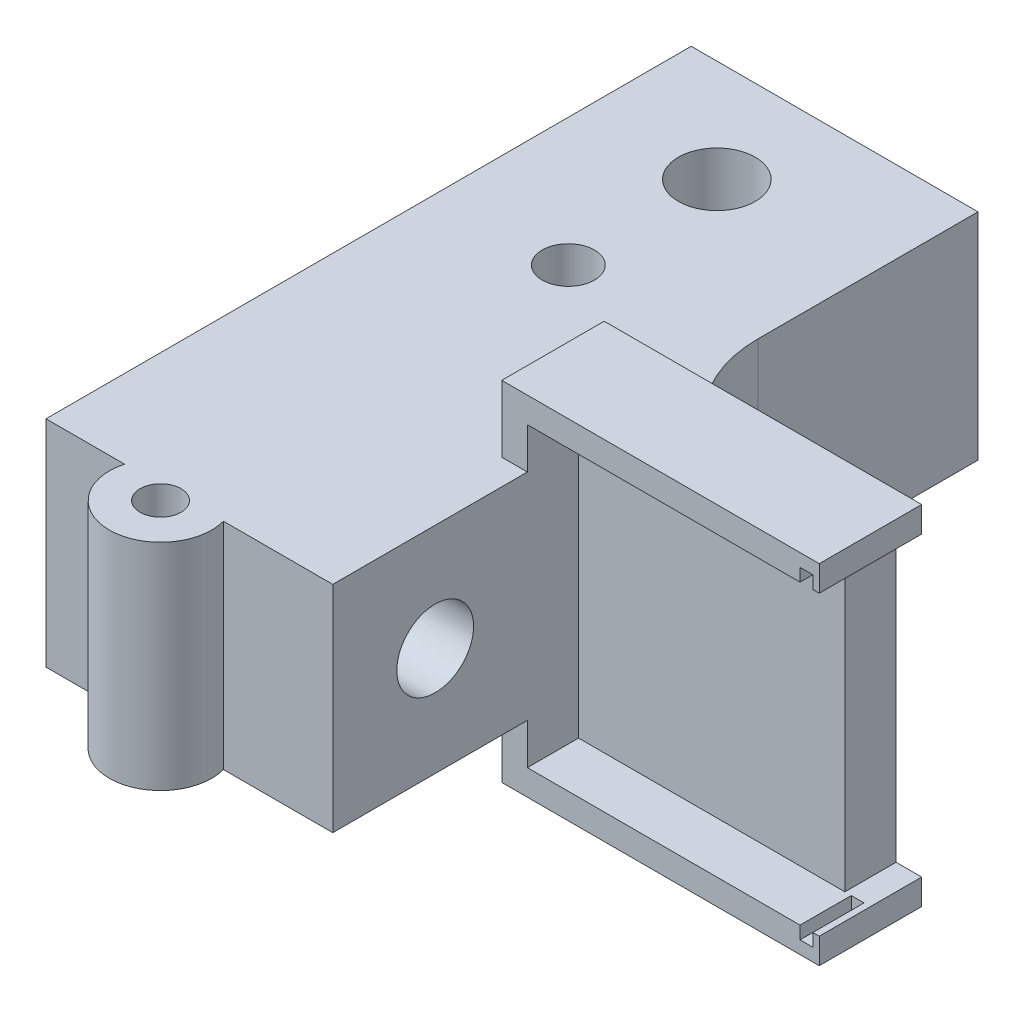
from build123d import *

# Parameters (mm, degrees)
SKETCH1_R                 = 5.1
BOSS_EXTRUDE3_DEPTH       = 42
SKETCH1_W                 = 56
SKETCH1_H                 = 126
SKETCH1_R_2               = 4
SKETCH1_R_3               = 11
BOSS_EXTRUDE3_2_DEPTH     = 42
SKETCH2_R                 = 4
CUT_EXTRUDE2_DEPTH        = 46
SKETCH3_R                 = 11
BOSS_EXTRUDE5_DEPTH       = 42
SKETCH3_2_R               = 11
CUT_EXTRUDE3_DEPTH        = 10
CUT_EXTRUDE5_DEPTH        = 594.161052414
CUT_EXTRUDE5_DEPTH_BACK   = 594.161052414
SKETCH1_5_R               = 5.1
CUT_EXTRUDE9_START        = -10
SKETCH6_R                 = 1.75
CUT_EXTRUDE9_DEPTH        = 5
SKETCH9_R                 = 4
CUT_EXTRUDE10_DEPTH       = 594.161052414
BOSS_EXTRUDE8_START       = -56
SKETCH7_W                 = 10
SKETCH7_H                 = 58
BOSS_EXTRUDE8_DEPTH       = 52
SKETCH2_3_R               = 4
CUT_EXTRUDE11_DEPTH       = 46
FILLET3_R                 = 25
BOSS_EXTRUDE11_DEPTH      = 10
BOSS_EXTRUDE11_DEPTH_BACK = 10
SKETCH11_5_W              = 2.5
SKETCH11_5_H              = 2.5
BOSS_EXTRUDE12_DEPTH      = 10
CUT_EXTRUDE13_START       = -42
SKETCH12_R                = 7.5
CUT_EXTRUDE13_DEPTH       = 28
SKETCH10_R                = 7.5
CUT_EXTRUDE14_DEPTH       = 25
SKETCH9_3_R               = 10
SKETCH9_3_R_2             = 4
BOSS_EXTRUDE13_DEPTH      = 42


with BuildPart() as part:
    # Sketch1 → Boss-Extrude3 (new body)
    with BuildSketch(Plane(origin=(0, 0, 0), x_dir=(1, 0, 0), z_dir=(0, 1, 0))):
        with Locations(Location((555.30421468, 30.519821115, 0), (0, 0, 90))):
            Circle(SKETCH1_R)
    extrude(amount=BOSS_EXTRUDE3_DEPTH)


with BuildPart() as body_2:
    # Sketch1 → Boss-Extrude3 2 (new body)
    with BuildSketch(Plane(origin=(0, 0, 0), x_dir=(1, 0, 0), z_dir=(0, 1, 0))):
        with Locations((558.30421468, 16.519821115)):
            Rectangle(SKETCH1_W, SKETCH1_H)
        with Locations(Location((555.30421468, 59.519821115, 0), (0, 0, 90))):
            Circle(SKETCH1_R_2, mode=Mode.SUBTRACT)
        with Locations(Location((555.30421468, 30.519821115, 0), (0, 0, 90))):
            Circle(SKETCH1_R_3, mode=Mode.SUBTRACT)
    extrude(amount=BOSS_EXTRUDE3_2_DEPTH)

    # Sketch2 → Cut-Extrude2 (cut)
    with BuildSketch(Plane.ZY.offset(-530.30421468)):
        with Locations((-1.519821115, 21.172874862)):
            Circle(SKETCH2_R)
    extrude(amount=-CUT_EXTRUDE2_DEPTH, mode=Mode.SUBTRACT)

    # Sketch3 → Boss-Extrude5 (add, through all)
    with BuildSketch(Plane.XZ):
        with Locations((555.30421468, -30.519821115)):
            Circle(SKETCH3_R)
    extrude(amount=-BOSS_EXTRUDE5_DEPTH)

    # Sketch3_2 → Cut-Extrude3 (cut)
    with BuildSketch(Plane.XZ):
        with Locations(Location((555.30421468, -30.519821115, 0), (0, 0, 270))):
            Circle(SKETCH3_2_R)
    extrude(amount=-CUT_EXTRUDE3_DEPTH, mode=Mode.SUBTRACT)


with BuildPart() as cut_extrude5_tool:
    # Sketch1_5 → Cut-Extrude5 (new, two sides: drawn at the far end of the back side and taken through both)
    with BuildSketch(Plane(origin=(0, 0, 0), x_dir=(1, 0, 0), z_dir=(0, 1, 0)).offset(-CUT_EXTRUDE5_DEPTH_BACK)):
        with Locations(Location((555.30421468, 30.519821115, 0), (0, 0, 90))):
            Circle(SKETCH1_5_R)
    extrude(amount=CUT_EXTRUDE5_DEPTH + CUT_EXTRUDE5_DEPTH_BACK)


with BuildPart() as part_1:
    add(part.part)

    # Cut-Extrude5: cut by cut_extrude5_tool
    add(cut_extrude5_tool.part, mode=Mode.SUBTRACT)


with BuildPart() as body_2_1:
    add(body_2.part)

    # Cut-Extrude5: cut by cut_extrude5_tool
    add(cut_extrude5_tool.part, mode=Mode.SUBTRACT)

    # Sketch6 → Cut-Extrude9 (cut)
    with BuildSketch(Plane.XZ.offset(CUT_EXTRUDE9_START)):
        with Locations(Location((555.30421468, -22.519821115, 0), (0, 0, 270))):
            Circle(SKETCH6_R)
        with Locations(Location((563.30421468, -30.519821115, 0), (0, 0, 270))):
            Circle(SKETCH6_R)
        with Locations(Location((555.30421468, -38.519821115, 0), (0, 0, 270))):
            Circle(SKETCH6_R)
        with Locations(Location((547.30421468, -30.519821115, 0), (0, 0, 270))):
            Circle(SKETCH6_R)
    extrude(amount=-CUT_EXTRUDE9_DEPTH, mode=Mode.SUBTRACT)

    # Sketch9 → Cut-Extrude10 (cut, through all)
    with BuildSketch(Plane.XZ):
        with Locations((555.30421468, 49.110178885)):
            Circle(SKETCH9_R)
    extrude(amount=-CUT_EXTRUDE10_DEPTH, mode=Mode.SUBTRACT)

    # Sketch7 → Boss-Extrude8 (add)
    with BuildSketch(Plane.ZY.offset(-530.30421468).offset(BOSS_EXTRUDE8_START)):
        with Locations((-6.519821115, 21)):
            Rectangle(SKETCH7_W, SKETCH7_H)
    extrude(amount=-BOSS_EXTRUDE8_DEPTH)

    # Sketch2_3 → Cut-Extrude11 (cut)
    with BuildSketch(Plane.ZY.offset(-530.30421468)):
        with Locations((26.480178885, 21.172874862)):
            Circle(SKETCH2_3_R)
    extrude(amount=-CUT_EXTRUDE11_DEPTH, mode=Mode.SUBTRACT)

    # Fillet3
    fillet3_edges = [body_2_1.edges().sort_by_distance(p)[0] for p in [
        (586.30421468, 21, -11.519821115),
    ]]
    fillet(fillet3_edges, radius=FILLET3_R)

    # Sketch11 → Boss-Extrude11 (add, two sides: drawn at the far end of the back side and taken through both)
    with BuildSketch(Plane.XY.offset(-1.519821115).offset(-BOSS_EXTRUDE11_DEPTH_BACK)):
        Polygon((643.30421468, -13), (643.30421468, -8), (642.05421468, -8), (642.05421468, -10.5), (639.55421468, -10.5), (639.55421468, -8), (586.30421468, -8), (586.30421468, 0), (581.30421468, 0), (581.30421468, -13), align=None)
        Polygon((642.05421468, 50), (643.30421468, 50), (643.30421468, 55), (581.30421468, 55), (581.30421468, 42), (586.30421468, 42), (586.30421468, 50), (639.55421468, 50), (639.55421468, 52.5), (642.05421468, 52.5), align=None)
    extrude(amount=BOSS_EXTRUDE11_DEPTH + BOSS_EXTRUDE11_DEPTH_BACK)

    # Sketch11_5 → Boss-Extrude12 (add)
    with BuildSketch(Plane.XY.offset(-1.519821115)):
        with Locations((640.80421468, 51.25)):
            Rectangle(SKETCH11_5_W, SKETCH11_5_H)
        with Locations((640.80421468, -9.25)):
            Rectangle(SKETCH11_5_W, SKETCH11_5_H)
    extrude(amount=-BOSS_EXTRUDE12_DEPTH)

    # Sketch12 → Cut-Extrude13 (cut)
    with BuildSketch(Plane.XZ.offset(CUT_EXTRUDE13_START)):
        with Locations(Location((555.30421468, -59.519821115, 0), (0, 0, 90))):
            Circle(SKETCH12_R)
    extrude(amount=CUT_EXTRUDE13_DEPTH, mode=Mode.SUBTRACT)

    # Sketch10 → Cut-Extrude14 (cut)
    with BuildSketch(Plane(origin=(586.30421468, 0, 0), x_dir=(0, 0, -1), z_dir=(1, 0, 0))):
        with Locations((-26.480178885, 21.172874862)):
            Circle(SKETCH10_R)
    extrude(amount=-CUT_EXTRUDE14_DEPTH, mode=Mode.SUBTRACT)

    # Sketch9_3 → Boss-Extrude13 (add)
    with BuildSketch(Plane.XZ):
        with Locations((555.30421468, 49.110178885)):
            Circle(SKETCH9_3_R)
        with Locations(Location((555.30421468, 49.110178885, 0), (0, 0, 270))):
            Circle(SKETCH9_3_R_2, mode=Mode.SUBTRACT)
    extrude(amount=-BOSS_EXTRUDE13_DEPTH)


solid = body_2_1.part
